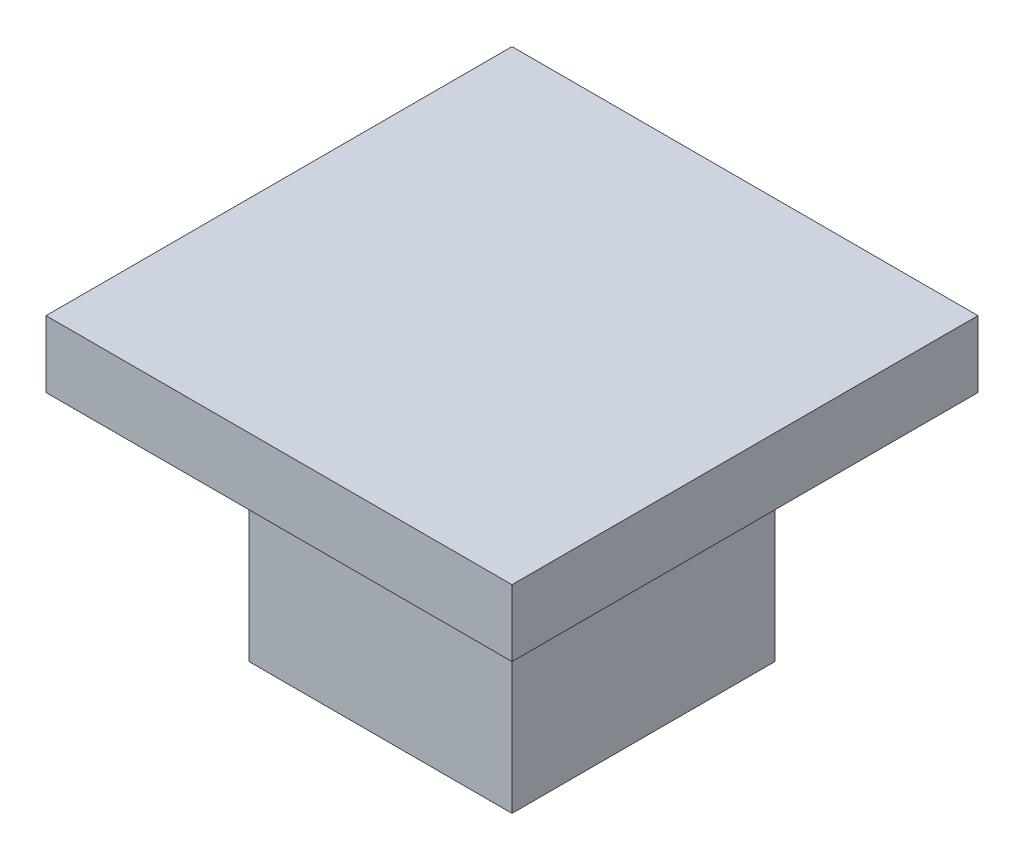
ISO-10303-21;
HEADER;
FILE_DESCRIPTION(('STEP AP214'),'2;1');
FILE_NAME('part.step','',(''),(''),'','','');
FILE_SCHEMA(('AUTOMOTIVE_DESIGN { 1 0 10303 214 1 1 1 1 }'));
ENDSEC;
DATA;
#1=APPLICATION_CONTEXT('core data for automotive mechanical design processes');
#2=APPLICATION_PROTOCOL_DEFINITION('international standard','automotive_design',2000,#1);
#3=PRODUCT_CONTEXT('',#1,'mechanical');
#4=PRODUCT('Part','Part','',(#3));
#5=PRODUCT_RELATED_PRODUCT_CATEGORY('part','',(#4));
#6=PRODUCT_DEFINITION_FORMATION('','',#4);
#7=PRODUCT_DEFINITION_CONTEXT('part definition',#1,'design');
#8=PRODUCT_DEFINITION('design','',#6,#7);
#9=PRODUCT_DEFINITION_SHAPE('','',#8);
#10=(LENGTH_UNIT() NAMED_UNIT(*) SI_UNIT(.MILLI.,.METRE.));
#11=(NAMED_UNIT(*) PLANE_ANGLE_UNIT() SI_UNIT($,.RADIAN.));
#12=(NAMED_UNIT(*) SI_UNIT($,.STERADIAN.) SOLID_ANGLE_UNIT());
#13=UNCERTAINTY_MEASURE_WITH_UNIT(LENGTH_MEASURE(1.E-05),#10,'distance_accuracy_value','');
#14=(GEOMETRIC_REPRESENTATION_CONTEXT(3) GLOBAL_UNCERTAINTY_ASSIGNED_CONTEXT((#13)) GLOBAL_UNIT_ASSIGNED_CONTEXT((#10,
#11,#12)) REPRESENTATION_CONTEXT('',''));
#15=CARTESIAN_POINT('',(0.,0.,0.));
#16=DIRECTION('',(0.,0.,1.));
#17=DIRECTION('',(1.,0.,0.));
#18=AXIS2_PLACEMENT_3D('',#15,#16,#17);
#19=CARTESIAN_POINT('',(3.95,7.,-3.95));
#20=DIRECTION('',(-1.,0.,0.));
#21=DIRECTION('',(0.,0.,1.));
#22=AXIS2_PLACEMENT_3D('',#19,#20,#21);
#23=PLANE('',#22);
#24=DIRECTION('',(0.,0.,-1.));
#25=VECTOR('',#24,1.);
#26=CARTESIAN_POINT('',(3.95,0.,-3.95));
#27=LINE('',#26,#25);
#28=CARTESIAN_POINT('',(3.95,0.,3.95));
#29=VERTEX_POINT('',#28);
#30=CARTESIAN_POINT('',(3.95,0.,-3.95));
#31=VERTEX_POINT('',#30);
#32=EDGE_CURVE('E132',#29,#31,#27,.T.);
#33=ORIENTED_EDGE('',*,*,#32,.T.);
#34=DIRECTION('',(0.,-1.,0.));
#35=VECTOR('',#34,1.);
#36=CARTESIAN_POINT('',(3.95,7.,-3.95));
#37=LINE('',#36,#35);
#38=CARTESIAN_POINT('',(3.95,7.,-3.95));
#39=VERTEX_POINT('',#38);
#40=EDGE_CURVE('E11',#39,#31,#37,.T.);
#41=ORIENTED_EDGE('',*,*,#40,.F.);
#42=DIRECTION('',(0.,0.,-1.));
#43=VECTOR('',#42,1.);
#44=CARTESIAN_POINT('',(3.95,7.,-3.95));
#45=LINE('',#44,#43);
#46=CARTESIAN_POINT('',(3.95,7.,3.95));
#47=VERTEX_POINT('',#46);
#48=EDGE_CURVE('E141',#47,#39,#45,.T.);
#49=ORIENTED_EDGE('',*,*,#48,.F.);
#50=DIRECTION('',(0.,-1.,0.));
#51=VECTOR('',#50,1.);
#52=CARTESIAN_POINT('',(3.95,7.,3.95));
#53=LINE('',#52,#51);
#54=EDGE_CURVE('E150',#47,#29,#53,.T.);
#55=ORIENTED_EDGE('',*,*,#54,.T.);
#56=EDGE_LOOP('',(#33,#41,#49,#55));
#57=FACE_BOUND('',#56,.T.);
#58=ADVANCED_FACE('F34',(#57),#23,.F.);
#59=CARTESIAN_POINT('',(-3.95,7.,-3.95));
#60=DIRECTION('',(0.,0.,1.));
#61=DIRECTION('',(1.,0.,0.));
#62=AXIS2_PLACEMENT_3D('',#59,#60,#61);
#63=PLANE('',#62);
#64=DIRECTION('',(-1.,0.,0.));
#65=VECTOR('',#64,1.);
#66=CARTESIAN_POINT('',(-3.95,0.,-3.95));
#67=LINE('',#66,#65);
#68=CARTESIAN_POINT('',(-3.95,0.,-3.95));
#69=VERTEX_POINT('',#68);
#70=EDGE_CURVE('E135',#31,#69,#67,.T.);
#71=ORIENTED_EDGE('',*,*,#70,.T.);
#72=DIRECTION('',(0.,-1.,0.));
#73=VECTOR('',#72,1.);
#74=CARTESIAN_POINT('',(-3.95,7.,-3.95));
#75=LINE('',#74,#73);
#76=CARTESIAN_POINT('',(-3.95,7.,-3.95));
#77=VERTEX_POINT('',#76);
#78=EDGE_CURVE('E42',#77,#69,#75,.T.);
#79=ORIENTED_EDGE('',*,*,#78,.F.);
#80=DIRECTION('',(-1.,0.,0.));
#81=VECTOR('',#80,1.);
#82=CARTESIAN_POINT('',(-3.95,7.,-3.95));
#83=LINE('',#82,#81);
#84=EDGE_CURVE('E76',#39,#77,#83,.T.);
#85=ORIENTED_EDGE('',*,*,#84,.F.);
#86=ORIENTED_EDGE('',*,*,#40,.T.);
#87=EDGE_LOOP('',(#71,#79,#85,#86));
#88=FACE_BOUND('',#87,.T.);
#89=ADVANCED_FACE('F176',(#88),#63,.F.);
#90=CARTESIAN_POINT('',(-3.95,7.,-3.95));
#91=DIRECTION('',(1.,0.,0.));
#92=DIRECTION('',(0.,0.,-1.));
#93=AXIS2_PLACEMENT_3D('',#90,#91,#92);
#94=PLANE('',#93);
#95=DIRECTION('',(0.,0.,1.));
#96=VECTOR('',#95,1.);
#97=CARTESIAN_POINT('',(-3.95,0.,-3.95));
#98=LINE('',#97,#96);
#99=CARTESIAN_POINT('',(-3.95,0.,3.95));
#100=VERTEX_POINT('',#99);
#101=EDGE_CURVE('E66',#69,#100,#98,.T.);
#102=ORIENTED_EDGE('',*,*,#101,.T.);
#103=DIRECTION('',(0.,-1.,0.));
#104=VECTOR('',#103,1.);
#105=CARTESIAN_POINT('',(-3.95,7.,3.95));
#106=LINE('',#105,#104);
#107=CARTESIAN_POINT('',(-3.95,7.,3.95));
#108=VERTEX_POINT('',#107);
#109=EDGE_CURVE('E50',#108,#100,#106,.T.);
#110=ORIENTED_EDGE('',*,*,#109,.F.);
#111=DIRECTION('',(0.,0.,1.));
#112=VECTOR('',#111,1.);
#113=CARTESIAN_POINT('',(-3.95,7.,-3.95));
#114=LINE('',#113,#112);
#115=EDGE_CURVE('E145',#77,#108,#114,.T.);
#116=ORIENTED_EDGE('',*,*,#115,.F.);
#117=ORIENTED_EDGE('',*,*,#78,.T.);
#118=EDGE_LOOP('',(#102,#110,#116,#117));
#119=FACE_BOUND('',#118,.T.);
#120=ADVANCED_FACE('F156',(#119),#94,.F.);
#121=CARTESIAN_POINT('',(-3.95,7.,3.95));
#122=DIRECTION('',(0.,0.,-1.));
#123=DIRECTION('',(-1.,0.,0.));
#124=AXIS2_PLACEMENT_3D('',#121,#122,#123);
#125=PLANE('',#124);
#126=DIRECTION('',(1.,0.,0.));
#127=VECTOR('',#126,1.);
#128=CARTESIAN_POINT('',(-3.95,0.,3.95));
#129=LINE('',#128,#127);
#130=EDGE_CURVE('E71',#100,#29,#129,.T.);
#131=ORIENTED_EDGE('',*,*,#130,.T.);
#132=ORIENTED_EDGE('',*,*,#54,.F.);
#133=DIRECTION('',(1.,0.,0.));
#134=VECTOR('',#133,1.);
#135=CARTESIAN_POINT('',(-3.95,7.,3.95));
#136=LINE('',#135,#134);
#137=EDGE_CURVE('E148',#108,#47,#136,.T.);
#138=ORIENTED_EDGE('',*,*,#137,.F.);
#139=ORIENTED_EDGE('',*,*,#109,.T.);
#140=EDGE_LOOP('',(#131,#132,#138,#139));
#141=FACE_BOUND('',#140,.T.);
#142=ADVANCED_FACE('F161',(#141),#125,.F.);
#143=CARTESIAN_POINT('',(0.,0.,0.));
#144=DIRECTION('',(0.,1.,0.));
#145=DIRECTION('',(0.,0.,1.));
#146=AXIS2_PLACEMENT_3D('',#143,#144,#145);
#147=PLANE('',#146);
#148=ORIENTED_EDGE('',*,*,#32,.F.);
#149=ORIENTED_EDGE('',*,*,#130,.F.);
#150=ORIENTED_EDGE('',*,*,#101,.F.);
#151=ORIENTED_EDGE('',*,*,#70,.F.);
#152=EDGE_LOOP('',(#148,#149,#150,#151));
#153=FACE_BOUND('',#152,.T.);
#154=ADVANCED_FACE('F159',(#153),#147,.F.);
#155=CARTESIAN_POINT('',(0.,7.,0.));
#156=DIRECTION('',(0.,1.,0.));
#157=DIRECTION('',(0.,0.,1.));
#158=AXIS2_PLACEMENT_3D('',#155,#156,#157);
#159=PLANE('',#158);
#160=DIRECTION('',(0.,0.,-1.));
#161=VECTOR('',#160,1.);
#162=CARTESIAN_POINT('',(7.,7.,-7.));
#163=LINE('',#162,#161);
#164=CARTESIAN_POINT('',(7.,7.,7.));
#165=VERTEX_POINT('',#164);
#166=CARTESIAN_POINT('',(7.,7.,-7.));
#167=VERTEX_POINT('',#166);
#168=EDGE_CURVE('E131',#165,#167,#163,.T.);
#169=ORIENTED_EDGE('',*,*,#168,.F.);
#170=DIRECTION('',(1.,0.,0.));
#171=VECTOR('',#170,1.);
#172=CARTESIAN_POINT('',(-7.,7.,7.));
#173=LINE('',#172,#171);
#174=CARTESIAN_POINT('',(-7.,7.,7.));
#175=VERTEX_POINT('',#174);
#176=EDGE_CURVE('E127',#175,#165,#173,.T.);
#177=ORIENTED_EDGE('',*,*,#176,.F.);
#178=DIRECTION('',(0.,0.,1.));
#179=VECTOR('',#178,1.);
#180=CARTESIAN_POINT('',(-7.,7.,-7.));
#181=LINE('',#180,#179);
#182=CARTESIAN_POINT('',(-7.,7.,-7.));
#183=VERTEX_POINT('',#182);
#184=EDGE_CURVE('E203',#183,#175,#181,.T.);
#185=ORIENTED_EDGE('',*,*,#184,.F.);
#186=DIRECTION('',(-1.,0.,0.));
#187=VECTOR('',#186,1.);
#188=CARTESIAN_POINT('',(-7.,7.,-7.));
#189=LINE('',#188,#187);
#190=EDGE_CURVE('E206',#167,#183,#189,.T.);
#191=ORIENTED_EDGE('',*,*,#190,.F.);
#192=EDGE_LOOP('',(#169,#177,#185,#191));
#193=FACE_BOUND('',#192,.T.);
#194=ORIENTED_EDGE('',*,*,#137,.T.);
#195=ORIENTED_EDGE('',*,*,#48,.T.);
#196=ORIENTED_EDGE('',*,*,#84,.T.);
#197=ORIENTED_EDGE('',*,*,#115,.T.);
#198=EDGE_LOOP('',(#194,#195,#196,#197));
#199=FACE_BOUND('',#198,.T.);
#200=ADVANCED_FACE('F163',(#193,#199),#159,.F.);
#201=CARTESIAN_POINT('',(7.,9.,-7.));
#202=DIRECTION('',(-1.,0.,0.));
#203=DIRECTION('',(0.,0.,1.));
#204=AXIS2_PLACEMENT_3D('',#201,#202,#203);
#205=PLANE('',#204);
#206=ORIENTED_EDGE('',*,*,#168,.T.);
#207=DIRECTION('',(0.,-1.,0.));
#208=VECTOR('',#207,1.);
#209=CARTESIAN_POINT('',(7.,9.,-7.));
#210=LINE('',#209,#208);
#211=CARTESIAN_POINT('',(7.,9.,-7.));
#212=VERTEX_POINT('',#211);
#213=EDGE_CURVE('E111',#212,#167,#210,.T.);
#214=ORIENTED_EDGE('',*,*,#213,.F.);
#215=DIRECTION('',(0.,0.,-1.));
#216=VECTOR('',#215,1.);
#217=CARTESIAN_POINT('',(7.,9.,-7.));
#218=LINE('',#217,#216);
#219=CARTESIAN_POINT('',(7.,9.,7.));
#220=VERTEX_POINT('',#219);
#221=EDGE_CURVE('E118',#220,#212,#218,.T.);
#222=ORIENTED_EDGE('',*,*,#221,.F.);
#223=DIRECTION('',(0.,-1.,0.));
#224=VECTOR('',#223,1.);
#225=CARTESIAN_POINT('',(7.,9.,7.));
#226=LINE('',#225,#224);
#227=EDGE_CURVE('E200',#220,#165,#226,.T.);
#228=ORIENTED_EDGE('',*,*,#227,.T.);
#229=EDGE_LOOP('',(#206,#214,#222,#228));
#230=FACE_BOUND('',#229,.T.);
#231=ADVANCED_FACE('F129',(#230),#205,.F.);
#232=CARTESIAN_POINT('',(-7.,9.,-7.));
#233=DIRECTION('',(0.,0.,1.));
#234=DIRECTION('',(1.,0.,0.));
#235=AXIS2_PLACEMENT_3D('',#232,#233,#234);
#236=PLANE('',#235);
#237=ORIENTED_EDGE('',*,*,#190,.T.);
#238=DIRECTION('',(0.,-1.,0.));
#239=VECTOR('',#238,1.);
#240=CARTESIAN_POINT('',(-7.,9.,-7.));
#241=LINE('',#240,#239);
#242=CARTESIAN_POINT('',(-7.,9.,-7.));
#243=VERTEX_POINT('',#242);
#244=EDGE_CURVE('E114',#243,#183,#241,.T.);
#245=ORIENTED_EDGE('',*,*,#244,.F.);
#246=DIRECTION('',(-1.,0.,0.));
#247=VECTOR('',#246,1.);
#248=CARTESIAN_POINT('',(-7.,9.,-7.));
#249=LINE('',#248,#247);
#250=EDGE_CURVE('E107',#212,#243,#249,.T.);
#251=ORIENTED_EDGE('',*,*,#250,.F.);
#252=ORIENTED_EDGE('',*,*,#213,.T.);
#253=EDGE_LOOP('',(#237,#245,#251,#252));
#254=FACE_BOUND('',#253,.T.);
#255=ADVANCED_FACE('F109',(#254),#236,.F.);
#256=CARTESIAN_POINT('',(-7.,9.,-7.));
#257=DIRECTION('',(1.,0.,0.));
#258=DIRECTION('',(0.,0.,-1.));
#259=AXIS2_PLACEMENT_3D('',#256,#257,#258);
#260=PLANE('',#259);
#261=ORIENTED_EDGE('',*,*,#184,.T.);
#262=DIRECTION('',(0.,-1.,0.));
#263=VECTOR('',#262,1.);
#264=CARTESIAN_POINT('',(-7.,9.,7.));
#265=LINE('',#264,#263);
#266=CARTESIAN_POINT('',(-7.,9.,7.));
#267=VERTEX_POINT('',#266);
#268=EDGE_CURVE('E137',#267,#175,#265,.T.);
#269=ORIENTED_EDGE('',*,*,#268,.F.);
#270=DIRECTION('',(0.,0.,1.));
#271=VECTOR('',#270,1.);
#272=CARTESIAN_POINT('',(-7.,9.,-7.));
#273=LINE('',#272,#271);
#274=EDGE_CURVE('E117',#243,#267,#273,.T.);
#275=ORIENTED_EDGE('',*,*,#274,.F.);
#276=ORIENTED_EDGE('',*,*,#244,.T.);
#277=EDGE_LOOP('',(#261,#269,#275,#276));
#278=FACE_BOUND('',#277,.T.);
#279=ADVANCED_FACE('F189',(#278),#260,.F.);
#280=CARTESIAN_POINT('',(-7.,9.,7.));
#281=DIRECTION('',(0.,0.,-1.));
#282=DIRECTION('',(-1.,0.,0.));
#283=AXIS2_PLACEMENT_3D('',#280,#281,#282);
#284=PLANE('',#283);
#285=ORIENTED_EDGE('',*,*,#176,.T.);
#286=ORIENTED_EDGE('',*,*,#227,.F.);
#287=DIRECTION('',(1.,0.,0.));
#288=VECTOR('',#287,1.);
#289=CARTESIAN_POINT('',(-7.,9.,7.));
#290=LINE('',#289,#288);
#291=EDGE_CURVE('E123',#267,#220,#290,.T.);
#292=ORIENTED_EDGE('',*,*,#291,.F.);
#293=ORIENTED_EDGE('',*,*,#268,.T.);
#294=EDGE_LOOP('',(#285,#286,#292,#293));
#295=FACE_BOUND('',#294,.T.);
#296=ADVANCED_FACE('F191',(#295),#284,.F.);
#297=CARTESIAN_POINT('',(0.,9.,0.));
#298=DIRECTION('',(0.,1.,0.));
#299=DIRECTION('',(0.,0.,1.));
#300=AXIS2_PLACEMENT_3D('',#297,#298,#299);
#301=PLANE('',#300);
#302=ORIENTED_EDGE('',*,*,#221,.T.);
#303=ORIENTED_EDGE('',*,*,#250,.T.);
#304=ORIENTED_EDGE('',*,*,#274,.T.);
#305=ORIENTED_EDGE('',*,*,#291,.T.);
#306=EDGE_LOOP('',(#302,#303,#304,#305));
#307=FACE_BOUND('',#306,.T.);
#308=ADVANCED_FACE('F121',(#307),#301,.T.);
#309=CLOSED_SHELL('',(#58,#89,#120,#142,#154,#200,#231,#255,#279,#296,#308));
#310=MANIFOLD_SOLID_BREP('B2',#309);
#311=ADVANCED_BREP_SHAPE_REPRESENTATION('',(#18,#310),#14);
#312=SHAPE_DEFINITION_REPRESENTATION(#9,#311);
ENDSEC;
END-ISO-10303-21;
